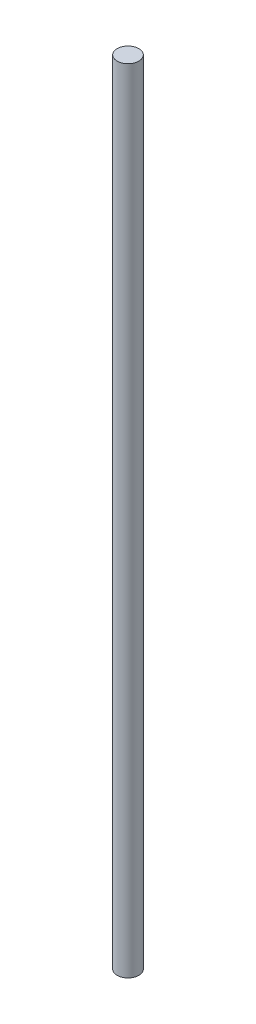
ISO-10303-21;
HEADER;
FILE_DESCRIPTION(('STEP AP214'),'2;1');
FILE_NAME('part.step','',(''),(''),'','','');
FILE_SCHEMA(('AUTOMOTIVE_DESIGN { 1 0 10303 214 1 1 1 1 }'));
ENDSEC;
DATA;
#1=APPLICATION_CONTEXT('core data for automotive mechanical design processes');
#2=APPLICATION_PROTOCOL_DEFINITION('international standard','automotive_design',2000,#1);
#3=PRODUCT_CONTEXT('',#1,'mechanical');
#4=PRODUCT('Part','Part','',(#3));
#5=PRODUCT_RELATED_PRODUCT_CATEGORY('part','',(#4));
#6=PRODUCT_DEFINITION_FORMATION('','',#4);
#7=PRODUCT_DEFINITION_CONTEXT('part definition',#1,'design');
#8=PRODUCT_DEFINITION('design','',#6,#7);
#9=PRODUCT_DEFINITION_SHAPE('','',#8);
#10=(LENGTH_UNIT() NAMED_UNIT(*) SI_UNIT(.MILLI.,.METRE.));
#11=(NAMED_UNIT(*) PLANE_ANGLE_UNIT() SI_UNIT($,.RADIAN.));
#12=(NAMED_UNIT(*) SI_UNIT($,.STERADIAN.) SOLID_ANGLE_UNIT());
#13=UNCERTAINTY_MEASURE_WITH_UNIT(LENGTH_MEASURE(1.E-05),#10,'distance_accuracy_value','');
#14=(GEOMETRIC_REPRESENTATION_CONTEXT(3) GLOBAL_UNCERTAINTY_ASSIGNED_CONTEXT((#13)) GLOBAL_UNIT_ASSIGNED_CONTEXT((#10,
#11,#12)) REPRESENTATION_CONTEXT('',''));
#15=CARTESIAN_POINT('',(0.,0.,0.));
#16=DIRECTION('',(0.,0.,1.));
#17=DIRECTION('',(1.,0.,0.));
#18=AXIS2_PLACEMENT_3D('',#15,#16,#17);
#19=CARTESIAN_POINT('',(0.,292.1,0.));
#20=DIRECTION('',(0.,-1.,0.));
#21=DIRECTION('',(0.,0.,-1.));
#22=AXIS2_PLACEMENT_3D('',#19,#20,#21);
#23=CYLINDRICAL_SURFACE('',#22,4.);
#24=CARTESIAN_POINT('',(0.,292.1,0.));
#25=DIRECTION('',(0.,1.,0.));
#26=DIRECTION('',(0.,0.,1.));
#27=AXIS2_PLACEMENT_3D('',#24,#25,#26);
#28=CIRCLE('',#27,4.);
#29=CARTESIAN_POINT('',(0.,292.1,4.));
#30=VERTEX_POINT('',#29);
#31=EDGE_CURVE('E10',#30,#30,#28,.T.);
#32=ORIENTED_EDGE('',*,*,#31,.F.);
#33=EDGE_LOOP('',(#32));
#34=FACE_BOUND('',#33,.T.);
#35=CARTESIAN_POINT('',(0.,0.,0.));
#36=DIRECTION('',(0.,1.,0.));
#37=DIRECTION('',(0.,0.,1.));
#38=AXIS2_PLACEMENT_3D('',#35,#36,#37);
#39=CIRCLE('',#38,4.);
#40=CARTESIAN_POINT('',(0.,0.,4.));
#41=VERTEX_POINT('',#40);
#42=EDGE_CURVE('E36',#41,#41,#39,.T.);
#43=ORIENTED_EDGE('',*,*,#42,.T.);
#44=EDGE_LOOP('',(#43));
#45=FACE_BOUND('',#44,.T.);
#46=ADVANCED_FACE('F34',(#34,#45),#23,.T.);
#47=CARTESIAN_POINT('',(0.,292.1,0.));
#48=DIRECTION('',(0.,1.,0.));
#49=DIRECTION('',(0.,0.,1.));
#50=AXIS2_PLACEMENT_3D('',#47,#48,#49);
#51=PLANE('',#50);
#52=ORIENTED_EDGE('',*,*,#31,.T.);
#53=EDGE_LOOP('',(#52));
#54=FACE_BOUND('',#53,.T.);
#55=ADVANCED_FACE('F49',(#54),#51,.T.);
#56=CARTESIAN_POINT('',(0.,0.,0.));
#57=DIRECTION('',(0.,1.,0.));
#58=DIRECTION('',(0.,0.,1.));
#59=AXIS2_PLACEMENT_3D('',#56,#57,#58);
#60=PLANE('',#59);
#61=ORIENTED_EDGE('',*,*,#42,.F.);
#62=EDGE_LOOP('',(#61));
#63=FACE_BOUND('',#62,.T.);
#64=ADVANCED_FACE('F48',(#63),#60,.F.);
#65=CLOSED_SHELL('',(#46,#55,#64));
#66=MANIFOLD_SOLID_BREP('B2',#65);
#67=ADVANCED_BREP_SHAPE_REPRESENTATION('',(#18,#66),#14);
#68=SHAPE_DEFINITION_REPRESENTATION(#9,#67);
ENDSEC;
END-ISO-10303-21;
